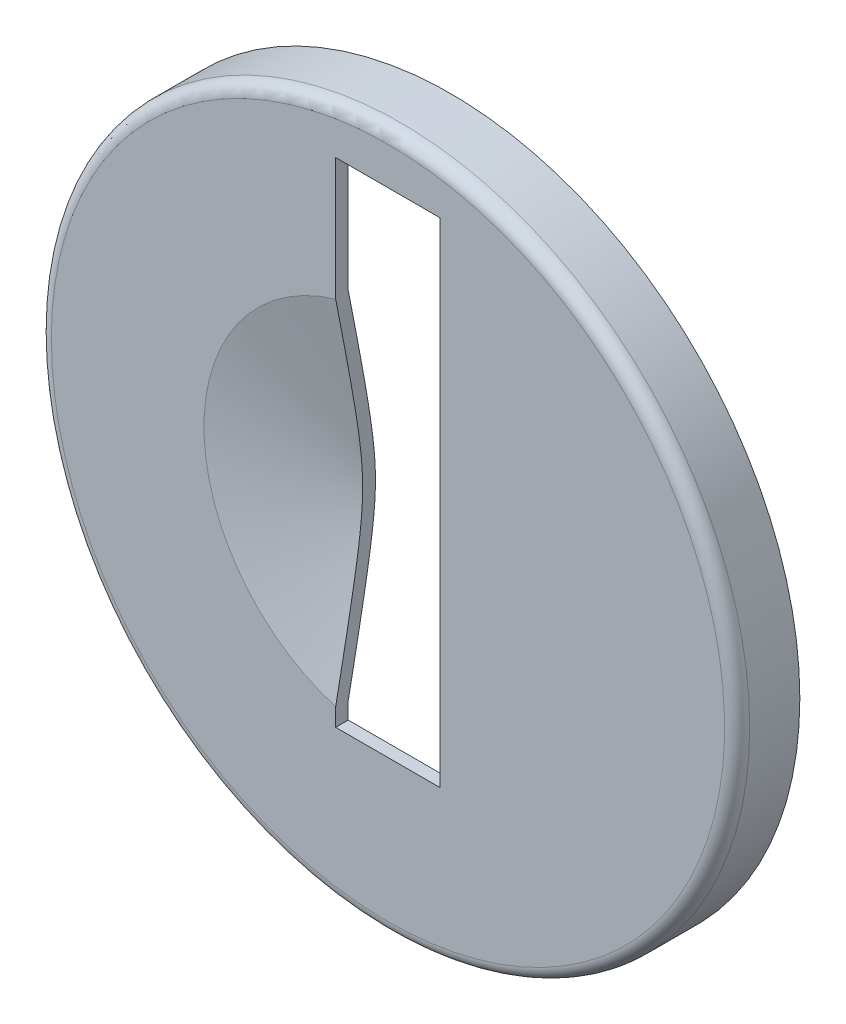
ISO-10303-21;
HEADER;
FILE_DESCRIPTION(('STEP AP214'),'2;1');
FILE_NAME('part.step','',(''),(''),'','','');
FILE_SCHEMA(('AUTOMOTIVE_DESIGN { 1 0 10303 214 1 1 1 1 }'));
ENDSEC;
DATA;
#1=APPLICATION_CONTEXT('core data for automotive mechanical design processes');
#2=APPLICATION_PROTOCOL_DEFINITION('international standard','automotive_design',2000,#1);
#3=PRODUCT_CONTEXT('',#1,'mechanical');
#4=PRODUCT('Part','Part','',(#3));
#5=PRODUCT_RELATED_PRODUCT_CATEGORY('part','',(#4));
#6=PRODUCT_DEFINITION_FORMATION('','',#4);
#7=PRODUCT_DEFINITION_CONTEXT('part definition',#1,'design');
#8=PRODUCT_DEFINITION('design','',#6,#7);
#9=PRODUCT_DEFINITION_SHAPE('','',#8);
#10=(LENGTH_UNIT() NAMED_UNIT(*) SI_UNIT(.MILLI.,.METRE.));
#11=(NAMED_UNIT(*) PLANE_ANGLE_UNIT() SI_UNIT($,.RADIAN.));
#12=(NAMED_UNIT(*) SI_UNIT($,.STERADIAN.) SOLID_ANGLE_UNIT());
#13=UNCERTAINTY_MEASURE_WITH_UNIT(LENGTH_MEASURE(1.E-05),#10,'distance_accuracy_value','');
#14=(GEOMETRIC_REPRESENTATION_CONTEXT(3) GLOBAL_UNCERTAINTY_ASSIGNED_CONTEXT((#13)) GLOBAL_UNIT_ASSIGNED_CONTEXT((#10,
#11,#12)) REPRESENTATION_CONTEXT('',''));
#15=CARTESIAN_POINT('',(0.,0.,0.));
#16=DIRECTION('',(0.,0.,1.));
#17=DIRECTION('',(1.,0.,0.));
#18=AXIS2_PLACEMENT_3D('',#15,#16,#17);
#19=CARTESIAN_POINT('',(0.,0.,-1.5));
#20=DIRECTION('',(0.,0.,-1.));
#21=DIRECTION('',(-1.,0.,0.));
#22=AXIS2_PLACEMENT_3D('',#19,#20,#21);
#23=PLANE('',#22);
#24=CARTESIAN_POINT('',(0.,0.,-1.5));
#25=DIRECTION('',(0.,0.,-1.));
#26=DIRECTION('',(-1.,0.,0.));
#27=AXIS2_PLACEMENT_3D('',#24,#25,#26);
#28=CIRCLE('',#27,8.05);
#29=CARTESIAN_POINT('',(-8.05,0.,-1.5));
#30=VERTEX_POINT('',#29);
#31=EDGE_CURVE('E19',#30,#30,#28,.F.);
#32=ORIENTED_EDGE('',*,*,#31,.T.);
#33=EDGE_LOOP('',(#32));
#34=FACE_BOUND('',#33,.T.);
#35=CARTESIAN_POINT('',(0.,0.,-1.5));
#36=DIRECTION('',(0.,0.,-1.));
#37=DIRECTION('',(-1.,0.,0.));
#38=AXIS2_PLACEMENT_3D('',#35,#36,#37);
#39=CIRCLE('',#38,8.35);
#40=CARTESIAN_POINT('',(-8.35,0.,-1.5));
#41=VERTEX_POINT('',#40);
#42=EDGE_CURVE('E293',#41,#41,#39,.F.);
#43=ORIENTED_EDGE('',*,*,#42,.F.);
#44=EDGE_LOOP('',(#43));
#45=FACE_BOUND('',#44,.T.);
#46=ADVANCED_FACE('F16',(#34,#45),#23,.T.);
#47=CARTESIAN_POINT('',(0.,0.,0.));
#48=DIRECTION('',(0.,0.,-1.));
#49=DIRECTION('',(-1.,0.,0.));
#50=AXIS2_PLACEMENT_3D('',#47,#48,#49);
#51=CYLINDRICAL_SURFACE('',#50,8.05);
#52=ORIENTED_EDGE('',*,*,#31,.F.);
#53=EDGE_LOOP('',(#52));
#54=FACE_BOUND('',#53,.T.);
#55=CARTESIAN_POINT('',(0.,0.,-0.3));
#56=DIRECTION('',(0.,0.,-1.));
#57=DIRECTION('',(-1.,0.,0.));
#58=AXIS2_PLACEMENT_3D('',#55,#56,#57);
#59=CIRCLE('',#58,8.05);
#60=CARTESIAN_POINT('',(-8.05,0.,-0.3));
#61=VERTEX_POINT('',#60);
#62=EDGE_CURVE('E78',#61,#61,#59,.T.);
#63=ORIENTED_EDGE('',*,*,#62,.F.);
#64=EDGE_LOOP('',(#63));
#65=FACE_BOUND('',#64,.T.);
#66=ADVANCED_FACE('F110',(#54,#65),#51,.F.);
#67=CARTESIAN_POINT('',(0.,0.,0.));
#68=DIRECTION('',(0.,0.,-1.));
#69=DIRECTION('',(-1.,0.,0.));
#70=AXIS2_PLACEMENT_3D('',#67,#68,#69);
#71=CYLINDRICAL_SURFACE('',#70,8.35);
#72=ORIENTED_EDGE('',*,*,#42,.T.);
#73=EDGE_LOOP('',(#72));
#74=FACE_BOUND('',#73,.T.);
#75=CARTESIAN_POINT('',(0.,0.,-0.3));
#76=DIRECTION('',(0.,0.,-1.));
#77=DIRECTION('',(-1.,0.,0.));
#78=AXIS2_PLACEMENT_3D('',#75,#76,#77);
#79=CIRCLE('',#78,8.35);
#80=CARTESIAN_POINT('',(-8.35,0.,-0.3));
#81=VERTEX_POINT('',#80);
#82=EDGE_CURVE('E77',#81,#81,#79,.F.);
#83=ORIENTED_EDGE('',*,*,#82,.F.);
#84=EDGE_LOOP('',(#83));
#85=FACE_BOUND('',#84,.T.);
#86=ADVANCED_FACE('F107',(#74,#85),#71,.T.);
#87=CARTESIAN_POINT('',(0.,0.,-0.299999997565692));
#88=DIRECTION('',(0.,0.,1.));
#89=DIRECTION('',(1.,0.,0.));
#90=AXIS2_PLACEMENT_3D('',#87,#88,#89);
#91=CONICAL_SURFACE('',#90,4.43036743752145,1.36903398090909);
#92=CARTESIAN_POINT('',(-1.25000000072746,4.25037123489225,-0.299999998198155));
#93=CARTESIAN_POINT('',(-1.25000000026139,4.07139876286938,-0.335102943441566));
#94=CARTESIAN_POINT('',(-1.25000000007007,3.89239876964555,-0.370068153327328));
#95=CARTESIAN_POINT('',(-1.24999999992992,3.53427542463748,-0.439502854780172));
#96=CARTESIAN_POINT('',(-1.24999999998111,3.35515205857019,-0.473972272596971));
#97=CARTESIAN_POINT('',(-1.25000000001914,2.9943670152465,-0.542641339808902));
#98=CARTESIAN_POINT('',(-1.25000000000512,2.81270346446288,-0.576831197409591));
#99=CARTESIAN_POINT('',(-1.24999999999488,2.44917566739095,-0.643996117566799));
#100=CARTESIAN_POINT('',(-1.24999999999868,2.26731144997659,-0.676971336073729));
#101=CARTESIAN_POINT('',(-1.25000000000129,1.90796285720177,-0.740029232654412));
#102=CARTESIAN_POINT('',(-1.25000000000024,1.73048797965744,-0.770164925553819));
#103=CARTESIAN_POINT('',(-1.24999999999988,1.46378821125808,-0.812646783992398));
#104=CARTESIAN_POINT('',(-1.24999999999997,1.37478211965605,-0.826357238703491));
#105=CARTESIAN_POINT('',(-1.25000000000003,1.19658276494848,-0.852493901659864));
#106=CARTESIAN_POINT('',(-1.25000000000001,1.10738950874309,-0.864920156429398));
#107=CARTESIAN_POINT('',(-1.24999999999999,0.929450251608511,-0.887904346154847));
#108=CARTESIAN_POINT('',(-1.25,0.840706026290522,-0.898475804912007));
#109=CARTESIAN_POINT('',(-1.25,0.662958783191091,-0.917213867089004));
#110=CARTESIAN_POINT('',(-1.25,0.573955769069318,-0.925380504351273));
#111=CARTESIAN_POINT('',(-1.25,0.395820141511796,-0.938553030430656));
#112=CARTESIAN_POINT('',(-1.25,0.306687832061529,-0.943562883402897));
#113=CARTESIAN_POINT('',(-1.25,0.128293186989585,-0.949813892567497));
#114=CARTESIAN_POINT('',(-1.25,0.0390308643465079,-0.951055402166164));
#115=CARTESIAN_POINT('',(-1.25,-0.137422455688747,-0.949608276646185));
#116=CARTESIAN_POINT('',(-1.25,-0.224614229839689,-0.947008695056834));
#117=CARTESIAN_POINT('',(-1.25,-0.398830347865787,-0.938389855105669));
#118=CARTESIAN_POINT('',(-1.25,-0.485854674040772,-0.932370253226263));
#119=CARTESIAN_POINT('',(-1.25,-0.659770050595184,-0.917554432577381));
#120=CARTESIAN_POINT('',(-1.25,-0.746660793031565,-0.90875471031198));
#121=CARTESIAN_POINT('',(-1.25,-0.920199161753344,-0.889063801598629));
#122=CARTESIAN_POINT('',(-1.25,-1.00684678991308,-0.878172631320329));
#123=CARTESIAN_POINT('',(-1.25,-1.18059493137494,-0.854774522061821));
#124=CARTESIAN_POINT('',(-1.25,-1.26769384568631,-0.84225587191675));
#125=CARTESIAN_POINT('',(-1.25,-1.44172323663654,-0.816092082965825));
#126=CARTESIAN_POINT('',(-1.25,-1.52865370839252,-0.802446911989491));
#127=CARTESIAN_POINT('',(-1.25,-1.78914696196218,-0.760315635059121));
#128=CARTESIAN_POINT('',(-1.25,-1.9625128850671,-0.730619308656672));
#129=CARTESIAN_POINT('',(-1.25,-2.31345433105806,-0.66865523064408));
#130=CARTESIAN_POINT('',(-1.25,-2.49102141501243,-0.63634054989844));
#131=CARTESIAN_POINT('',(-1.25,-2.84594998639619,-0.57059521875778));
#132=CARTESIAN_POINT('',(-1.25,-3.02331147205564,-0.5371645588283));
#133=CARTESIAN_POINT('',(-1.25,-3.37568658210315,-0.470027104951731));
#134=CARTESIAN_POINT('',(-1.25,-3.55070186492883,-0.436328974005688));
#135=CARTESIAN_POINT('',(-1.25,-3.900610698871,-0.368464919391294));
#136=CARTESIAN_POINT('',(-1.25,-4.07550426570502,-0.334299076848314));
#137=CARTESIAN_POINT('',(-1.25,-4.25037123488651,-0.299999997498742));
#138=B_SPLINE_CURVE_WITH_KNOTS('',3,(#92,#93,#94,#95,#96,#97,#98,#99,#100,#101,#102,#103,#104,
#105,#106,#107,#108,#109,#110,#111,#112,#113,#114,#115,#116,#117,#118,#119,#120,#121,#122,#123,
#124,#125,#126,#127,#128,#129,#130,#131,#132,#133,#134,#135,#136,#137),.UNSPECIFIED.,.F.,.F.,(4,
2,2,2,2,2,2,2,2,2,2,2,2,2,2,2,2,2,2,2,2,2,4),(0.,0.547148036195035,1.09437663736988,
1.64893240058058,2.20341671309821,2.7434372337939,3.01359844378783,3.28374986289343,
3.55184132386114,3.81992901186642,4.08767937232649,4.35540462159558,4.61701940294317,
4.87866046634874,5.14063257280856,5.40260265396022,5.6665746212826,5.93055412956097,
6.45820621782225,6.99965297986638,7.54110436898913,8.07579356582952,8.61039116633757),.UNSPECIFIED.);
#139=CARTESIAN_POINT('',(-1.25,4.25037123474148,-0.299999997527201));
#140=VERTEX_POINT('',#139);
#141=CARTESIAN_POINT('',(-1.25,-4.25037122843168,-0.299999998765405));
#142=VERTEX_POINT('',#141);
#143=EDGE_CURVE('E81',#140,#142,#138,.T.);
#144=ORIENTED_EDGE('',*,*,#143,.T.);
#145=CARTESIAN_POINT('',(0.,0.,-0.299999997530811));
#146=DIRECTION('',(0.,0.,1.));
#147=DIRECTION('',(1.,0.,0.));
#148=AXIS2_PLACEMENT_3D('',#145,#146,#147);
#149=CIRCLE('',#148,4.43036743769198);
#150=EDGE_CURVE('E65',#140,#142,#149,.T.);
#151=ORIENTED_EDGE('',*,*,#150,.F.);
#152=EDGE_LOOP('',(#144,#151));
#153=FACE_BOUND('',#152,.T.);
#154=ADVANCED_FACE('F84',(#153),#91,.T.);
#155=CARTESIAN_POINT('',(0.,0.,-0.3));
#156=DIRECTION('',(0.,0.,-1.));
#157=DIRECTION('',(-1.,0.,0.));
#158=AXIS2_PLACEMENT_3D('',#155,#156,#157);
#159=PLANE('',#158);
#160=ORIENTED_EDGE('',*,*,#150,.T.);
#161=DIRECTION('',(0.,1.,0.));
#162=VECTOR('',#161,1.);
#163=CARTESIAN_POINT('',(-1.25,7.15,-0.3));
#164=LINE('',#163,#162);
#165=CARTESIAN_POINT('',(-1.25,-4.65,-0.3));
#166=VERTEX_POINT('',#165);
#167=EDGE_CURVE('E73',#142,#166,#164,.F.);
#168=ORIENTED_EDGE('',*,*,#167,.T.);
#169=DIRECTION('',(1.,0.,0.));
#170=VECTOR('',#169,1.);
#171=CARTESIAN_POINT('',(-1.25,-4.65,-0.3));
#172=LINE('',#171,#170);
#173=CARTESIAN_POINT('',(1.25,-4.65,-0.3));
#174=VERTEX_POINT('',#173);
#175=EDGE_CURVE('E182',#166,#174,#172,.T.);
#176=ORIENTED_EDGE('',*,*,#175,.T.);
#177=DIRECTION('',(0.,1.,0.));
#178=VECTOR('',#177,1.);
#179=CARTESIAN_POINT('',(1.25,-4.65,-0.3));
#180=LINE('',#179,#178);
#181=CARTESIAN_POINT('',(1.25,7.15,-0.3));
#182=VERTEX_POINT('',#181);
#183=EDGE_CURVE('E171',#174,#182,#180,.T.);
#184=ORIENTED_EDGE('',*,*,#183,.T.);
#185=DIRECTION('',(1.,0.,0.));
#186=VECTOR('',#185,1.);
#187=CARTESIAN_POINT('',(1.25,7.15,-0.3));
#188=LINE('',#187,#186);
#189=CARTESIAN_POINT('',(-1.25,7.15,-0.3));
#190=VERTEX_POINT('',#189);
#191=EDGE_CURVE('E160',#182,#190,#188,.F.);
#192=ORIENTED_EDGE('',*,*,#191,.T.);
#193=DIRECTION('',(0.,1.,0.));
#194=VECTOR('',#193,1.);
#195=CARTESIAN_POINT('',(-1.25,7.15,-0.3));
#196=LINE('',#195,#194);
#197=EDGE_CURVE('E76',#190,#140,#196,.F.);
#198=ORIENTED_EDGE('',*,*,#197,.T.);
#199=EDGE_LOOP('',(#160,#168,#176,#184,#192,#198));
#200=FACE_BOUND('',#199,.T.);
#201=ORIENTED_EDGE('',*,*,#62,.T.);
#202=EDGE_LOOP('',(#201));
#203=FACE_BOUND('',#202,.T.);
#204=ADVANCED_FACE('F70',(#200,#203),#159,.T.);
#205=CARTESIAN_POINT('',(0.,0.,-0.3));
#206=DIRECTION('',(0.,0.,-1.));
#207=DIRECTION('',(-1.,0.,0.));
#208=AXIS2_PLACEMENT_3D('',#205,#206,#207);
#209=TOROIDAL_SURFACE('',#208,8.05,0.3);
#210=ORIENTED_EDGE('',*,*,#82,.T.);
#211=EDGE_LOOP('',(#210));
#212=FACE_BOUND('',#211,.T.);
#213=CARTESIAN_POINT('',(0.,0.,0.));
#214=DIRECTION('',(0.,0.,-1.));
#215=DIRECTION('',(-1.,0.,0.));
#216=AXIS2_PLACEMENT_3D('',#213,#214,#215);
#217=CIRCLE('',#216,8.05);
#218=CARTESIAN_POINT('',(-8.05,0.,0.));
#219=VERTEX_POINT('',#218);
#220=EDGE_CURVE('E176',#219,#219,#217,.T.);
#221=ORIENTED_EDGE('',*,*,#220,.T.);
#222=EDGE_LOOP('',(#221));
#223=FACE_BOUND('',#222,.T.);
#224=ADVANCED_FACE('F190',(#212,#223),#209,.T.);
#225=CARTESIAN_POINT('',(1.25,-4.65,0.));
#226=DIRECTION('',(1.,0.,0.));
#227=DIRECTION('',(0.,0.,-1.));
#228=AXIS2_PLACEMENT_3D('',#225,#226,#227);
#229=PLANE('',#228);
#230=DIRECTION('',(0.,0.,1.));
#231=VECTOR('',#230,1.);
#232=CARTESIAN_POINT('',(1.25,7.15,0.));
#233=LINE('',#232,#231);
#234=CARTESIAN_POINT('',(1.25,7.15,0.));
#235=VERTEX_POINT('',#234);
#236=EDGE_CURVE('E168',#235,#182,#233,.F.);
#237=ORIENTED_EDGE('',*,*,#236,.T.);
#238=ORIENTED_EDGE('',*,*,#183,.F.);
#239=DIRECTION('',(0.,0.,-1.));
#240=VECTOR('',#239,1.);
#241=CARTESIAN_POINT('',(1.25,-4.65,0.));
#242=LINE('',#241,#240);
#243=CARTESIAN_POINT('',(1.25,-4.65,0.));
#244=VERTEX_POINT('',#243);
#245=EDGE_CURVE('E179',#174,#244,#242,.F.);
#246=ORIENTED_EDGE('',*,*,#245,.T.);
#247=DIRECTION('',(0.,1.,0.));
#248=VECTOR('',#247,1.);
#249=CARTESIAN_POINT('',(1.25,0.,0.));
#250=LINE('',#249,#248);
#251=EDGE_CURVE('E165',#244,#235,#250,.T.);
#252=ORIENTED_EDGE('',*,*,#251,.T.);
#253=EDGE_LOOP('',(#237,#238,#246,#252));
#254=FACE_BOUND('',#253,.T.);
#255=ADVANCED_FACE('F194',(#254),#229,.F.);
#256=CARTESIAN_POINT('',(1.25,7.15,0.));
#257=DIRECTION('',(0.,1.,0.));
#258=DIRECTION('',(0.,0.,1.));
#259=AXIS2_PLACEMENT_3D('',#256,#257,#258);
#260=PLANE('',#259);
#261=DIRECTION('',(0.,0.,1.));
#262=VECTOR('',#261,1.);
#263=CARTESIAN_POINT('',(-1.25,7.15,0.));
#264=LINE('',#263,#262);
#265=CARTESIAN_POINT('',(-1.25,7.15,0.));
#266=VERTEX_POINT('',#265);
#267=EDGE_CURVE('E86',#266,#190,#264,.F.);
#268=ORIENTED_EDGE('',*,*,#267,.T.);
#269=ORIENTED_EDGE('',*,*,#191,.F.);
#270=ORIENTED_EDGE('',*,*,#236,.F.);
#271=DIRECTION('',(-1.,0.,0.));
#272=VECTOR('',#271,1.);
#273=CARTESIAN_POINT('',(0.,7.15,0.));
#274=LINE('',#273,#272);
#275=EDGE_CURVE('E148',#235,#266,#274,.T.);
#276=ORIENTED_EDGE('',*,*,#275,.T.);
#277=EDGE_LOOP('',(#268,#269,#270,#276));
#278=FACE_BOUND('',#277,.T.);
#279=ADVANCED_FACE('F226',(#278),#260,.F.);
#280=CARTESIAN_POINT('',(-1.25,7.15,0.));
#281=DIRECTION('',(-1.,0.,0.));
#282=DIRECTION('',(0.,0.,1.));
#283=AXIS2_PLACEMENT_3D('',#280,#281,#282);
#284=PLANE('',#283);
#285=CARTESIAN_POINT('',(-1.2500000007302,4.21870833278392,1.80688189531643E-09));
#286=CARTESIAN_POINT('',(-1.25000000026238,4.04105902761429,-0.0348223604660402));
#287=CARTESIAN_POINT('',(-1.25000000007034,3.86338202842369,-0.069506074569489));
#288=CARTESIAN_POINT('',(-1.24999999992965,3.50790514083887,-0.138374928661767));
#289=CARTESIAN_POINT('',(-1.24999999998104,3.33010523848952,-0.172559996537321));
#290=CARTESIAN_POINT('',(-1.25000000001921,2.9720019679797,-0.24064965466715));
#291=CARTESIAN_POINT('',(-1.25000000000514,2.79169673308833,-0.274544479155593));
#292=CARTESIAN_POINT('',(-1.24999999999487,2.43088407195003,-0.341115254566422));
#293=CARTESIAN_POINT('',(-1.24999999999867,2.25037667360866,-0.373791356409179));
#294=CARTESIAN_POINT('',(-1.25000000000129,1.89368542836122,-0.436258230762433));
#295=CARTESIAN_POINT('',(-1.25000000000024,1.71751103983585,-0.466101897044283));
#296=CARTESIAN_POINT('',(-1.24999999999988,1.45276507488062,-0.508146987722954));
#297=CARTESIAN_POINT('',(-1.24999999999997,1.36441152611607,-0.52171194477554));
#298=CARTESIAN_POINT('',(-1.25000000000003,1.18751846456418,-0.547561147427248));
#299=CARTESIAN_POINT('',(-1.25000000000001,1.09897895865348,-0.559845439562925));
#300=CARTESIAN_POINT('',(-1.24999999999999,0.922338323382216,-0.582556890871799));
#301=CARTESIAN_POINT('',(-1.25,0.834238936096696,-0.592997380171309));
#302=CARTESIAN_POINT('',(-1.25,0.657785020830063,-0.611493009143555));
#303=CARTESIAN_POINT('',(-1.25,0.569430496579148,-0.619548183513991));
#304=CARTESIAN_POINT('',(-1.25,0.392593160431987,-0.632533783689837));
#305=CARTESIAN_POINT('',(-1.25,0.304110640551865,-0.63746804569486));
#306=CARTESIAN_POINT('',(-1.25,0.127018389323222,-0.643620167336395));
#307=CARTESIAN_POINT('',(-1.25,0.038408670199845,-0.644838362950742));
#308=CARTESIAN_POINT('',(-1.25,-0.1367409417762,-0.643402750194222));
#309=CARTESIAN_POINT('',(-1.25,-0.223281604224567,-0.64083728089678));
#310=CARTESIAN_POINT('',(-1.25,-0.396198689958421,-0.632333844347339));
#311=CARTESIAN_POINT('',(-1.25,-0.482575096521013,-0.62639555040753));
#312=CARTESIAN_POINT('',(-1.25,-0.655195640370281,-0.611773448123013));
#313=CARTESIAN_POINT('',(-1.25,-0.741439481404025,-0.603086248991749));
#314=CARTESIAN_POINT('',(-1.25,-0.913687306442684,-0.583637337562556));
#315=CARTESIAN_POINT('',(-1.25,-0.999691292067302,-0.572875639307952));
#316=CARTESIAN_POINT('',(-1.25,-1.17214300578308,-0.549746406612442));
#317=CARTESIAN_POINT('',(-1.25,-1.25858916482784,-0.537367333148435));
#318=CARTESIAN_POINT('',(-1.25,-1.43131412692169,-0.511486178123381));
#319=CARTESIAN_POINT('',(-1.25,-1.51759292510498,-0.497984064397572));
#320=CARTESIAN_POINT('',(-1.25,-1.77613484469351,-0.456282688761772));
#321=CARTESIAN_POINT('',(-1.25,-1.9482018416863,-0.426874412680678));
#322=CARTESIAN_POINT('',(-1.25,-2.29649036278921,-0.365494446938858));
#323=CARTESIAN_POINT('',(-1.25,-2.47270348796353,-0.333475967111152));
#324=CARTESIAN_POINT('',(-1.25,-2.82492379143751,-0.268319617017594));
#325=CARTESIAN_POINT('',(-1.25,-3.00093096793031,-0.235181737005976));
#326=CARTESIAN_POINT('',(-1.25,-3.35063018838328,-0.168620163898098));
#327=CARTESIAN_POINT('',(-1.25,-3.52432388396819,-0.135205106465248));
#328=CARTESIAN_POINT('',(-1.25,-3.87159007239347,-0.0679046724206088));
#329=CARTESIAN_POINT('',(-1.25,-4.04516258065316,-0.0340193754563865));
#330=CARTESIAN_POINT('',(-1.25,-4.21870833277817,2.50864461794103E-09));
#331=B_SPLINE_CURVE_WITH_KNOTS('',3,(#285,#286,#287,#288,#289,#290,#291,#292,#293,#294,#295,
#296,#297,#298,#299,#300,#301,#302,#303,#304,#305,#306,#307,#308,#309,#310,#311,#312,#313,#314,
#315,#316,#317,#318,#319,#320,#321,#322,#323,#324,#325,#326,#327,#328,#329,#330),.UNSPECIFIED.,
.F.,.F.,(4,2,2,2,2,2,2,2,2,2,2,2,2,2,2,2,2,2,2,2,2,2,4),(0.,0.543090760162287,1.08625929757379,
1.63664668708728,2.18696569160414,2.7229929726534,2.99115292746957,3.25930313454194,
3.52542736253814,3.79154771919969,4.05734032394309,4.32310889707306,4.58276984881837,
4.84245595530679,5.10246364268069,5.36246956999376,5.62444365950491,5.88642525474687,
6.41009048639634,6.94738186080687,7.48467791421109,8.01531329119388,8.54585986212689),.UNSPECIFIED.);
#332=CARTESIAN_POINT('',(-1.25,4.21870833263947,2.48144413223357E-09));
#333=VERTEX_POINT('',#332);
#334=CARTESIAN_POINT('',(-1.25,-4.21870832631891,1.24187015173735E-09));
#335=VERTEX_POINT('',#334);
#336=EDGE_CURVE('E94',#333,#335,#331,.T.);
#337=ORIENTED_EDGE('',*,*,#336,.T.);
#338=DIRECTION('',(0.,1.,0.));
#339=VECTOR('',#338,1.);
#340=CARTESIAN_POINT('',(-1.25,7.15,0.));
#341=LINE('',#340,#339);
#342=CARTESIAN_POINT('',(-1.25,-4.65,0.));
#343=VERTEX_POINT('',#342);
#344=EDGE_CURVE('E34',#343,#335,#341,.T.);
#345=ORIENTED_EDGE('',*,*,#344,.F.);
#346=DIRECTION('',(0.,0.,-1.));
#347=VECTOR('',#346,1.);
#348=CARTESIAN_POINT('',(-1.25,-4.65,0.));
#349=LINE('',#348,#347);
#350=EDGE_CURVE('E82',#343,#166,#349,.T.);
#351=ORIENTED_EDGE('',*,*,#350,.T.);
#352=ORIENTED_EDGE('',*,*,#167,.F.);
#353=ORIENTED_EDGE('',*,*,#143,.F.);
#354=ORIENTED_EDGE('',*,*,#197,.F.);
#355=ORIENTED_EDGE('',*,*,#267,.F.);
#356=DIRECTION('',(0.,1.,0.));
#357=VECTOR('',#356,1.);
#358=CARTESIAN_POINT('',(-1.25,0.,0.));
#359=LINE('',#358,#357);
#360=EDGE_CURVE('E140',#266,#333,#359,.F.);
#361=ORIENTED_EDGE('',*,*,#360,.T.);
#362=EDGE_LOOP('',(#337,#345,#351,#352,#353,#354,#355,#361));
#363=FACE_BOUND('',#362,.T.);
#364=ADVANCED_FACE('F80',(#363),#284,.F.);
#365=CARTESIAN_POINT('',(0.,0.,2.44426701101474E-09));
#366=DIRECTION('',(0.,0.,1.));
#367=DIRECTION('',(1.,0.,0.));
#368=AXIS2_PLACEMENT_3D('',#365,#366,#367);
#369=CONICAL_SURFACE('',#368,4.39999999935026,1.36903398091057);
#370=CARTESIAN_POINT('',(0.,0.,2.47914802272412E-09));
#371=DIRECTION('',(0.,0.,1.));
#372=DIRECTION('',(1.,0.,0.));
#373=AXIS2_PLACEMENT_3D('',#370,#371,#372);
#374=CIRCLE('',#373,4.39999999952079);
#375=EDGE_CURVE('E25',#333,#335,#374,.T.);
#376=ORIENTED_EDGE('',*,*,#375,.T.);
#377=ORIENTED_EDGE('',*,*,#336,.F.);
#378=EDGE_LOOP('',(#376,#377));
#379=FACE_BOUND('',#378,.T.);
#380=ADVANCED_FACE('F129',(#379),#369,.F.);
#381=CARTESIAN_POINT('',(-1.25,-4.65,0.));
#382=DIRECTION('',(0.,-1.,0.));
#383=DIRECTION('',(0.,0.,-1.));
#384=AXIS2_PLACEMENT_3D('',#381,#382,#383);
#385=PLANE('',#384);
#386=ORIENTED_EDGE('',*,*,#245,.F.);
#387=ORIENTED_EDGE('',*,*,#175,.F.);
#388=ORIENTED_EDGE('',*,*,#350,.F.);
#389=DIRECTION('',(-1.,0.,0.));
#390=VECTOR('',#389,1.);
#391=CARTESIAN_POINT('',(0.,-4.65,0.));
#392=LINE('',#391,#390);
#393=EDGE_CURVE('E11',#343,#244,#392,.F.);
#394=ORIENTED_EDGE('',*,*,#393,.T.);
#395=EDGE_LOOP('',(#386,#387,#388,#394));
#396=FACE_BOUND('',#395,.T.);
#397=ADVANCED_FACE('F123',(#396),#385,.F.);
#398=CARTESIAN_POINT('',(0.,0.,0.));
#399=DIRECTION('',(0.,0.,-1.));
#400=DIRECTION('',(-1.,0.,0.));
#401=AXIS2_PLACEMENT_3D('',#398,#399,#400);
#402=PLANE('',#401);
#403=ORIENTED_EDGE('',*,*,#344,.T.);
#404=ORIENTED_EDGE('',*,*,#375,.F.);
#405=ORIENTED_EDGE('',*,*,#360,.F.);
#406=ORIENTED_EDGE('',*,*,#275,.F.);
#407=ORIENTED_EDGE('',*,*,#251,.F.);
#408=ORIENTED_EDGE('',*,*,#393,.F.);
#409=EDGE_LOOP('',(#403,#404,#405,#406,#407,#408));
#410=FACE_BOUND('',#409,.T.);
#411=ORIENTED_EDGE('',*,*,#220,.F.);
#412=EDGE_LOOP('',(#411));
#413=FACE_BOUND('',#412,.T.);
#414=ADVANCED_FACE('F121',(#410,#413),#402,.F.);
#415=CLOSED_SHELL('',(#46,#66,#86,#154,#204,#224,#255,#279,#364,#380,#397,#414));
#416=MANIFOLD_SOLID_BREP('B1',#415);
#417=ADVANCED_BREP_SHAPE_REPRESENTATION('',(#18,#416),#14);
#418=SHAPE_DEFINITION_REPRESENTATION(#9,#417);
ENDSEC;
END-ISO-10303-21;
